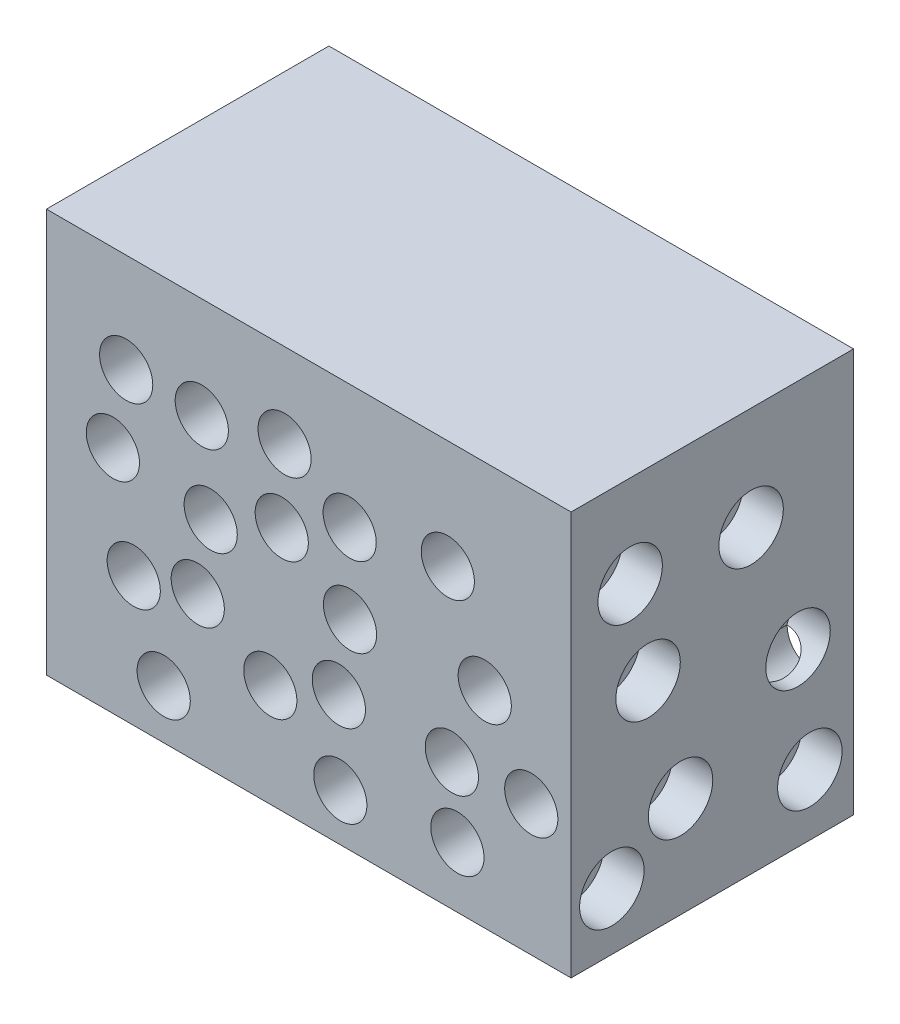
from build123d import *

# Parameters (mm, degrees)
SKETCH1_W           = 130
SKETCH1_H           = 100
BOSS_EXTRUDE1_DEPTH = 70
SKETCH2_R           = 6.590931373
CUT_EXTRUDE1_DEPTH  = 108.819293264
SKETCH3_R           = 7.986416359
CUT_EXTRUDE2_DEPTH  = 10
CUT_EXTRUDE3_DEPTH  = 5


with BuildPart() as part:
    # Sketch1 → Boss-Extrude1 (new body)
    with BuildSketch(Plane.XY):
        Rectangle(SKETCH1_W, SKETCH1_H)
    extrude(amount=BOSS_EXTRUDE1_DEPTH)

    # Sketch2 → Cut-Extrude1 (cut, through all)
    with BuildSketch(Plane.XY.offset(70)):
        with Locations((-45.241978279, 25.415228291)):
            Circle(SKETCH2_R)
        with Locations((-24.299306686, 3.741449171)):
            Circle(SKETCH2_R)
        with Locations((-5.990579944, 29.10797753)):
            Circle(SKETCH2_R)
        with Locations((-43.364896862, -17.856680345)):
            Circle(SKETCH2_R)
        with Locations((10.223924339, -0.457053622)):
            Circle(SKETCH2_R)
        with Locations((-9.526516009, -24.496489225)):
            Circle(SKETCH2_R)
        with Locations((35.461259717, -18.426822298)):
            Circle(SKETCH2_R)
        with Locations((34.45675601, 23.050907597)):
            Circle(SKETCH2_R)
        with Locations((10.139416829, 19.260062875)):
            Circle(SKETCH2_R)
        with Locations((43.611860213, 0.997041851)):
            Circle(SKETCH2_R)
        with Locations((7.817401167, -38.272100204)):
            Circle(SKETCH2_R)
        with Locations((-35.94175961, -37.760754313)):
            Circle(SKETCH2_R)
        with Locations((36.836842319, -34.986228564)):
            Circle(SKETCH2_R)
        with Locations((55.138957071, -17.55430708)):
            Circle(SKETCH2_R)
        with Locations((7.460275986, -17.944584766)):
            Circle(SKETCH2_R)
        with Locations((-27.502376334, -13.799084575)):
            Circle(SKETCH2_R)
        with Locations((-48.53949118, 7.036011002)):
            Circle(SKETCH2_R)
        with Locations((-26.50229542, 24.918454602)):
            Circle(SKETCH2_R)
        with Locations((-6.688654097, 10.797457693)):
            Circle(SKETCH2_R)
    extrude(amount=-CUT_EXTRUDE1_DEPTH, mode=Mode.SUBTRACT)

    # Sketch3 → Cut-Extrude2 (cut)
    with BuildSketch(Plane(origin=(65, 0, 0), x_dir=(0, 0, -1), z_dir=(1, 0, 0))):
        with Locations((-55.359324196, 27.261364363)):
            Circle(SKETCH3_R)
        with Locations((-50.918684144, 4.273933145)):
            Circle(SKETCH3_R)
        with Locations((-25.38552554, 24.385732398)):
            Circle(SKETCH3_R)
        with Locations((-13.757680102, -7.569242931)):
            Circle(SKETCH3_R)
        with Locations((-42.872096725, -25.039424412)):
            Circle(SKETCH3_R)
        with Locations((-10.837611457, -34.854513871)):
            Circle(SKETCH3_R)
        with Locations((-59.89431544, -35.86145757)):
            Circle(SKETCH3_R)
    extrude(amount=-CUT_EXTRUDE2_DEPTH, mode=Mode.SUBTRACT)

    # Sketch4 → Cut-Extrude3 (cut)
    with BuildSketch(Plane.XZ.offset(50)):
        with BuildLine():
            Line((-40, 10), (40, 10))
            ThreePointArc((40, 10), (47.071067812, 12.928932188), (50, 20))
            Line((50, 20), (50, 50))
            ThreePointArc((50, 50), (47.071067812, 57.071067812), (40, 60))
            Line((40, 60), (-40, 60))
            ThreePointArc((-40, 60), (-47.071067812, 57.071067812), (-50, 50))
            Line((-50, 50), (-50, 20))
            ThreePointArc((-50, 20), (-47.071067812, 12.928932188), (-40, 10))
        make_face()
    extrude(amount=-CUT_EXTRUDE3_DEPTH, mode=Mode.SUBTRACT)


solid = part.part
